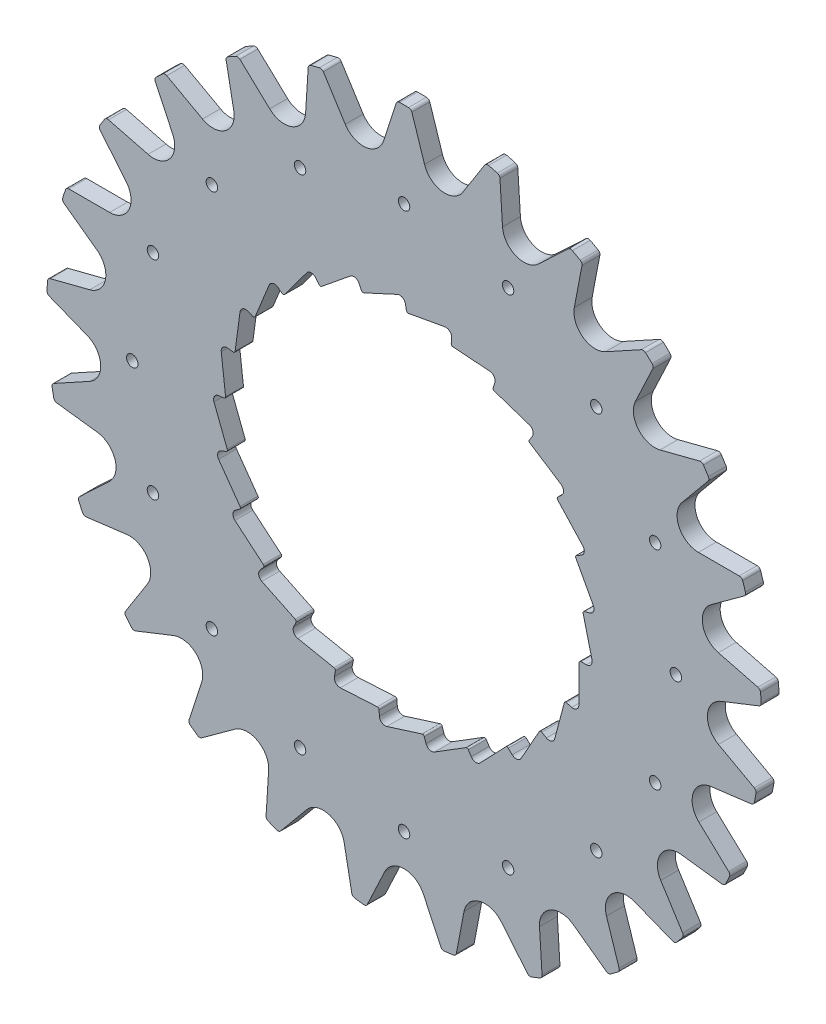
from build123d import *

# Parameters (mm, degrees)
ESQUISSE3_R        = 1.6
BOSS_EXTRU_1_DEPTH = 5


with BuildPart() as part:
    # Esquisse3 → Boss.-Extru.1 (new body)
    with BuildSketch(Plane.XY):
        with BuildLine():
            Line((-5.724871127, 88.406921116), (-2.195441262, 99.269389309))
            ThreePointArc((-2.195441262, 99.269389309), (-1.837244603, 99.765677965), (-1.256958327, 99.960293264))
            ThreePointArc((-1.256958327, 99.960293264), (0, 99.968195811), (1.256958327, 99.960293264))
            ThreePointArc((1.256958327, 99.960293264), (1.837244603, 99.765677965), (2.195441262, 99.269389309))
            Line((2.195441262, 99.269389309), (5.724871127, 88.406921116))
            ThreePointArc((5.724871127, 88.406921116), (7.596834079, 85.652411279), (10.653324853, 84.329749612))
            ThreePointArc((10.653324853, 84.329749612), (13.942722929, 84.850739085), (16.440893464, 87.053172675))
            Line((16.440893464, 87.053172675), (22.560825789, 96.69664294))
            ThreePointArc((22.560825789, 96.69664294), (23.031191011, 97.088259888), (23.641645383, 97.132449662))
            ThreePointArc((23.641645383, 97.132449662), (24.861079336, 96.827511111), (26.076582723, 96.507264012))
            ThreePointArc((26.076582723, 96.507264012), (26.590239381, 96.174451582), (26.813760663, 95.604674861))
            Line((26.813760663, 95.604674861), (27.53092101, 84.205737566))
            ThreePointArc((27.53092101, 84.205737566), (28.659054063, 81.072227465), (31.290586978, 79.031001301))
            ThreePointArc((31.290586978, 79.031001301), (34.606207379, 78.717582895), (37.573616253, 80.229553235))
            Line((37.573616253, 80.229553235), (45.899513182, 88.048090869))
            ThreePointArc((45.899513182, 88.048090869), (46.452492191, 88.310429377), (47.054757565, 88.201417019))
            ThreePointArc((47.054757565, 88.201417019), (48.160045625, 87.602797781), (49.257719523, 86.990328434))
            ThreePointArc((49.257719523, 86.990328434), (49.672471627, 86.540230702), (49.747272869, 85.932767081))
            Line((49.747272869, 85.932767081), (47.607101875, 74.713597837))
            ThreePointArc((47.607101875, 74.713597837), (47.92052028, 71.397977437), (49.961746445, 68.766444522))
            ThreePointArc((49.961746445, 68.766444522), (53.095256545, 67.638311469), (56.345450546, 68.364815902))
            Line((56.345450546, 68.364815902), (66.354165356, 73.867153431))
            ThreePointArc((66.354165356, 73.867153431), (66.955012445, 73.983729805), (67.511246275, 73.728364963))
            ThreePointArc((67.511246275, 73.728364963), (68.432939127, 72.873678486), (69.343812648, 72.007470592))
            ThreePointArc((69.343812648, 72.007470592), (69.633599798, 71.468368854), (69.554980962, 70.861387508))
            Line((69.554980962, 70.861387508), (64.691953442, 60.526927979))
            ThreePointArc((64.691953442, 60.526927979), (64.170963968, 57.237529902), (65.493625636, 54.181039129))
            ThreePointArc((65.493625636, 54.181039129), (68.248135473, 52.309076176), (71.576892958, 52.204465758))
            Line((71.576892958, 52.204465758), (82.639541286, 55.044871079))
            ThreePointArc((82.639541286, 55.044871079), (83.250503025, 55.008360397), (83.725755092, 54.622688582))
            ThreePointArc((83.725755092, 54.622688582), (84.405939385, 53.565637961), (85.072778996, 52.500118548))
            ThreePointArc((85.072778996, 52.500118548), (85.219392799, 51.905886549), (84.992293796, 51.337526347))
            Line((84.992293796, 51.337526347), (77.711971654, 42.537128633))
            ThreePointArc((77.711971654, 42.537128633), (76.389309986, 39.480637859), (76.91029946, 36.191239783))
            ThreePointArc((76.91029946, 36.191239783), (79.11273305, 33.693069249), (82.310895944, 32.763917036))
            Line((82.310895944, 32.763917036), (93.732370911, 32.763917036))
            ThreePointArc((93.732370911, 32.763917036), (94.315058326, 32.576613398), (94.679466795, 32.084867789))
            ThreePointArc((94.679466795, 32.084867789), (95.075404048, 30.891871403), (95.456309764, 29.693990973))
            ThreePointArc((95.456309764, 29.693990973), (95.450537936, 29.081966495), (95.089228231, 28.5879396))
            Line((95.089228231, 28.5879396), (85.849060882, 21.874565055))
            ThreePointArc((85.849060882, 21.874565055), (83.807834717, 19.24303214), (83.494416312, 15.92741174))
            ThreePointArc((83.494416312, 15.92741174), (85.006386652, 12.960002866), (87.87300262, 11.264690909))
            Line((87.87300262, 11.264690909), (98.935650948, 8.424285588))
            ThreePointArc((98.935650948, 8.424285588), (99.453451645, 8.097957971), (99.684119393, 7.531036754))
            ThreePointArc((99.684119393, 7.531036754), (99.770931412, 6.277054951), (99.841969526, 5.022080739))
            ThreePointArc((99.841969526, 5.022080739), (99.684174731, 4.430719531), (99.211356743, 4.042067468))
            Line((99.211356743, 4.042067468), (88.591937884, -0.162457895))
            ThreePointArc((88.591937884, -0.162457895), (85.96040497, -2.203684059), (84.832271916, -5.33719416))
            ThreePointArc((84.832271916, -5.33719416), (85.55877635, -8.587388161), (87.913725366, -10.942337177))
            Line((87.913725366, -10.942337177), (97.922440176, -16.444674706))
            ThreePointArc((97.922440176, -16.444674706), (98.342818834, -16.889521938), (98.425252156, -17.495997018))
            ThreePointArc((98.425252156, -17.495997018), (98.197484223, -18.732171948), (97.954191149, -19.965385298))
            ThreePointArc((97.954191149, -19.965385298), (97.654288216, -20.498925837), (97.099670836, -20.757782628))
            Line((97.099670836, -20.757782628), (85.768257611, -22.189273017))
            ThreePointArc((85.768257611, -22.189273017), (82.711766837, -23.511934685), (80.839803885, -26.266444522))
            ThreePointArc((80.839803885, -26.266444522), (80.735193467, -29.595202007), (82.430505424, -32.461817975))
            Line((82.430505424, -32.461817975), (90.756402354, -40.280355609))
            ThreePointArc((90.756402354, -40.280355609), (91.052945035, -40.815771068), (90.981964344, -41.423692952))
            ThreePointArc((90.981964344, -41.423692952), (90.453927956, -42.564387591), (89.911590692, -43.698352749))
            ThreePointArc((89.911590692, -43.698352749), (89.488423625, -44.140548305), (88.886855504, -44.2533449))
            Line((88.886855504, -44.2533449), (77.555442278, -42.82185451))
            ThreePointArc((77.555442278, -42.82185451), (74.266044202, -43.342843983), (71.767873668, -45.545277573))
            ThreePointArc((71.767873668, -45.545277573), (70.838721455, -48.743440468), (71.767873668, -51.941603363))
            Line((71.767873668, -51.941603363), (77.887805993, -61.585073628))
            ThreePointArc((77.887805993, -61.585073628), (78.041879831, -62.177415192), (77.821945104, -62.748585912))
            ThreePointArc((77.821945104, -62.748585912), (77.026818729, -63.722126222), (76.21951432, -64.685591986))
            ThreePointArc((76.21951432, -64.685591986), (75.699672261, -65.008657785), (75.088952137, -64.968306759))
            Line((75.088952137, -64.968306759), (64.469533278, -60.763781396))
            ThreePointArc((64.469533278, -60.763781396), (61.153912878, -60.45036299), (58.186504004, -61.962333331))
            ThreePointArc((58.186504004, -61.962333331), (56.491192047, -64.828949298), (56.595802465, -68.157706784))
            Line((56.595802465, -68.157706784), (60.125232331, -79.020174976))
            ThreePointArc((60.125232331, -79.020174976), (60.127156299, -79.632223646), (59.772086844, -80.130754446))
            ThreePointArc((59.772086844, -80.130754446), (58.759831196, -80.875969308), (57.738285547, -81.608397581))
            ThreePointArc((57.738285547, -81.608397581), (57.154432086, -81.792034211), (56.572933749, -81.601070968))
            Line((56.572933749, -81.601070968), (47.3327664, -74.887696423))
            ThreePointArc((47.3327664, -74.887696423), (44.1992563, -73.75956337), (40.949062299, -74.486067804))
            ThreePointArc((40.949062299, -74.486067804), (38.594113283, -76.84101682), (37.867608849, -80.091210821))
            Line((37.867608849, -80.091210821), (38.584769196, -91.490148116))
            ThreePointArc((38.584769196, -91.490148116), (38.434422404, -92.083446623), (37.966528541, -92.478012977))
            ThreePointArc((37.966528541, -92.478012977), (36.800747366, -92.948077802), (35.629147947, -93.403447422))
            ThreePointArc((35.629147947, -93.403447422), (35.017968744, -93.436116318), (34.502229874, -93.10653978))
            Line((34.502229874, -93.10653978), (27.221907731, -84.306142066))
            ThreePointArc((27.221907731, -84.306142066), (24.467397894, -82.434179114), (21.138640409, -82.329568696))
            ThreePointArc((21.138640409, -82.329568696), (18.272024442, -84.024880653), (16.760054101, -86.992289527))
            Line((16.760054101, -86.992289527), (14.619883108, -98.211458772))
            ThreePointArc((14.619883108, -98.211458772), (14.326712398, -98.748727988), (13.775393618, -99.014537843))
            ThreePointArc((13.775393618, -99.014537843), (12.529337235, -99.179916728), (11.281299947, -99.329615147))
            ThreePointArc((11.281299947, -99.329615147), (10.681197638, -99.209263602), (10.263624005, -98.761782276))
            Line((10.263624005, -98.761782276), (5.400596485, -88.427322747))
            ThreePointArc((5.400596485, -88.427322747), (3.198162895, -85.929152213), (0, -85))
            ThreePointArc((0, -85), (-3.198162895, -85.929152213), (-5.400596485, -88.427322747))
            Line((-5.400596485, -88.427322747), (-10.263624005, -98.761782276))
            ThreePointArc((-10.263624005, -98.761782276), (-10.681197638, -99.209263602), (-11.281299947, -99.329615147))
            ThreePointArc((-11.281299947, -99.329615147), (-12.529337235, -99.179916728), (-13.775393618, -99.014537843))
            ThreePointArc((-13.775393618, -99.014537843), (-14.326712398, -98.748727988), (-14.619883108, -98.211458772))
            Line((-14.619883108, -98.211458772), (-16.760054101, -86.992289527))
            ThreePointArc((-16.760054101, -86.992289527), (-18.272024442, -84.024880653), (-21.138640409, -82.329568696))
            ThreePointArc((-21.138640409, -82.329568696), (-24.467397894, -82.434179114), (-27.221907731, -84.306142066))
            Line((-27.221907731, -84.306142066), (-34.502229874, -93.10653978))
            ThreePointArc((-34.502229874, -93.10653978), (-35.017968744, -93.436116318), (-35.629147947, -93.403447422))
            ThreePointArc((-35.629147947, -93.403447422), (-36.800747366, -92.948077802), (-37.966528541, -92.478012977))
            ThreePointArc((-37.966528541, -92.478012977), (-38.434422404, -92.083446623), (-38.584769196, -91.490148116))
            Line((-38.584769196, -91.490148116), (-37.867608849, -80.091210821))
            ThreePointArc((-37.867608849, -80.091210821), (-38.594113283, -76.84101682), (-40.949062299, -74.486067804))
            ThreePointArc((-40.949062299, -74.486067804), (-44.1992563, -73.75956337), (-47.3327664, -74.887696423))
            Line((-47.3327664, -74.887696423), (-56.572933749, -81.601070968))
            ThreePointArc((-56.572933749, -81.601070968), (-57.154432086, -81.792034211), (-57.738285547, -81.608397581))
            ThreePointArc((-57.738285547, -81.608397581), (-58.759831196, -80.875969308), (-59.772086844, -80.130754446))
            ThreePointArc((-59.772086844, -80.130754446), (-60.127156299, -79.632223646), (-60.125232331, -79.020174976))
            Line((-60.125232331, -79.020174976), (-56.595802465, -68.157706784))
            ThreePointArc((-56.595802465, -68.157706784), (-56.491192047, -64.828949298), (-58.186504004, -61.962333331))
            ThreePointArc((-58.186504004, -61.962333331), (-61.153912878, -60.45036299), (-64.469533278, -60.763781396))
            Line((-64.469533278, -60.763781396), (-75.088952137, -64.968306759))
            ThreePointArc((-75.088952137, -64.968306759), (-75.699672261, -65.008657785), (-76.21951432, -64.685591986))
            ThreePointArc((-76.21951432, -64.685591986), (-77.026818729, -63.722126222), (-77.821945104, -62.748585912))
            ThreePointArc((-77.821945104, -62.748585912), (-78.041879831, -62.177415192), (-77.887805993, -61.585073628))
            Line((-77.887805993, -61.585073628), (-71.767873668, -51.941603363))
            ThreePointArc((-71.767873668, -51.941603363), (-70.838721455, -48.743440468), (-71.767873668, -45.545277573))
            ThreePointArc((-71.767873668, -45.545277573), (-74.266044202, -43.342843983), (-77.555442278, -42.82185451))
            Line((-77.555442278, -42.82185451), (-88.886855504, -44.2533449))
            ThreePointArc((-88.886855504, -44.2533449), (-89.488423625, -44.140548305), (-89.911590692, -43.698352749))
            ThreePointArc((-89.911590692, -43.698352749), (-90.453927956, -42.564387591), (-90.981964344, -41.423692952))
            ThreePointArc((-90.981964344, -41.423692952), (-91.052945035, -40.815771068), (-90.756402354, -40.280355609))
            Line((-90.756402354, -40.280355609), (-82.430505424, -32.461817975))
            ThreePointArc((-82.430505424, -32.461817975), (-80.735193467, -29.595202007), (-80.839803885, -26.266444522))
            ThreePointArc((-80.839803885, -26.266444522), (-82.711766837, -23.511934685), (-85.768257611, -22.189273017))
            Line((-85.768257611, -22.189273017), (-97.099670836, -20.757782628))
            ThreePointArc((-97.099670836, -20.757782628), (-97.654288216, -20.498925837), (-97.954191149, -19.965385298))
            ThreePointArc((-97.954191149, -19.965385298), (-98.197484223, -18.732171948), (-98.425252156, -17.495997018))
            ThreePointArc((-98.425252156, -17.495997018), (-98.342818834, -16.889521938), (-97.922440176, -16.444674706))
            Line((-97.922440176, -16.444674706), (-87.913725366, -10.942337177))
            ThreePointArc((-87.913725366, -10.942337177), (-85.55877635, -8.587388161), (-84.832271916, -5.33719416))
            ThreePointArc((-84.832271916, -5.33719416), (-85.96040497, -2.203684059), (-88.591937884, -0.162457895))
            Line((-88.591937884, -0.162457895), (-99.211356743, 4.042067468))
            ThreePointArc((-99.211356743, 4.042067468), (-99.684174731, 4.430719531), (-99.841969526, 5.022080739))
            ThreePointArc((-99.841969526, 5.022080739), (-99.770931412, 6.277054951), (-99.684119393, 7.531036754))
            ThreePointArc((-99.684119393, 7.531036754), (-99.453451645, 8.097957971), (-98.935650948, 8.424285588))
            Line((-98.935650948, 8.424285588), (-87.87300262, 11.264690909))
            ThreePointArc((-87.87300262, 11.264690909), (-85.006386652, 12.960002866), (-83.494416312, 15.92741174))
            ThreePointArc((-83.494416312, 15.92741174), (-83.807834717, 19.24303214), (-85.849060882, 21.874565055))
            Line((-85.849060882, 21.874565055), (-95.089228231, 28.5879396))
            ThreePointArc((-95.089228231, 28.5879396), (-95.450537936, 29.081966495), (-95.456309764, 29.693990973))
            ThreePointArc((-95.456309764, 29.693990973), (-95.075404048, 30.891871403), (-94.679466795, 32.084867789))
            ThreePointArc((-94.679466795, 32.084867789), (-94.315058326, 32.576613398), (-93.732370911, 32.763917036))
            Line((-93.732370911, 32.763917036), (-82.310895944, 32.763917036))
            ThreePointArc((-82.310895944, 32.763917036), (-79.11273305, 33.693069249), (-76.91029946, 36.191239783))
            ThreePointArc((-76.91029946, 36.191239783), (-76.389309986, 39.480637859), (-77.711971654, 42.537128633))
            Line((-77.711971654, 42.537128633), (-84.992293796, 51.337526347))
            ThreePointArc((-84.992293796, 51.337526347), (-85.219392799, 51.905886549), (-85.072778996, 52.500118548))
            ThreePointArc((-85.072778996, 52.500118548), (-84.405939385, 53.565637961), (-83.725755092, 54.622688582))
            ThreePointArc((-83.725755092, 54.622688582), (-83.250503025, 55.008360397), (-82.639541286, 55.044871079))
            Line((-82.639541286, 55.044871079), (-71.576892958, 52.204465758))
            ThreePointArc((-71.576892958, 52.204465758), (-68.248135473, 52.309076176), (-65.493625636, 54.181039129))
            ThreePointArc((-65.493625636, 54.181039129), (-64.170963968, 57.237529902), (-64.691953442, 60.526927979))
            Line((-64.691953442, 60.526927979), (-69.554980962, 70.861387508))
            ThreePointArc((-69.554980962, 70.861387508), (-69.633599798, 71.468368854), (-69.343812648, 72.007470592))
            ThreePointArc((-69.343812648, 72.007470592), (-68.432939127, 72.873678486), (-67.511246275, 73.728364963))
            ThreePointArc((-67.511246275, 73.728364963), (-66.955012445, 73.983729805), (-66.354165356, 73.867153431))
            Line((-66.354165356, 73.867153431), (-56.345450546, 68.364815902))
            ThreePointArc((-56.345450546, 68.364815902), (-53.095256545, 67.638311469), (-49.961746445, 68.766444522))
            ThreePointArc((-49.961746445, 68.766444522), (-47.92052028, 71.397977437), (-47.607101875, 74.713597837))
            Line((-47.607101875, 74.713597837), (-49.747272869, 85.932767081))
            ThreePointArc((-49.747272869, 85.932767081), (-49.672471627, 86.540230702), (-49.257719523, 86.990328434))
            ThreePointArc((-49.257719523, 86.990328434), (-48.160045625, 87.602797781), (-47.054757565, 88.201417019))
            ThreePointArc((-47.054757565, 88.201417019), (-46.452492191, 88.310429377), (-45.899513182, 88.048090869))
            Line((-45.899513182, 88.048090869), (-37.573616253, 80.229553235))
            ThreePointArc((-37.573616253, 80.229553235), (-34.606207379, 78.717582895), (-31.290586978, 79.031001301))
            ThreePointArc((-31.290586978, 79.031001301), (-28.659054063, 81.072227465), (-27.53092101, 84.205737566))
            Line((-27.53092101, 84.205737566), (-26.813760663, 95.604674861))
            ThreePointArc((-26.813760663, 95.604674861), (-26.590239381, 96.174451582), (-26.076582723, 96.507264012))
            ThreePointArc((-26.076582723, 96.507264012), (-24.861079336, 96.827511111), (-23.641645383, 97.132449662))
            ThreePointArc((-23.641645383, 97.132449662), (-23.031191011, 97.088259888), (-22.560825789, 96.69664294))
            Line((-22.560825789, 96.69664294), (-16.440893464, 87.053172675))
            ThreePointArc((-16.440893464, 87.053172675), (-13.942722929, 84.850739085), (-10.653324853, 84.329749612))
            ThreePointArc((-10.653324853, 84.329749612), (-7.596834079, 85.652411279), (-5.724871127, 88.406921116))
        make_face()
        with Locations((0, 76)):
            Circle(ESQUISSE3_R, mode=Mode.SUBTRACT)
        with Locations((29.08394086, 70.214844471)):
            Circle(ESQUISSE3_R, mode=Mode.SUBTRACT)
        with Locations((53.74011537, 53.74011537)):
            Circle(ESQUISSE3_R, mode=Mode.SUBTRACT)
        with Locations((70.214844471, 29.08394086)):
            Circle(ESQUISSE3_R, mode=Mode.SUBTRACT)
        with Locations((76, 0)):
            Circle(ESQUISSE3_R, mode=Mode.SUBTRACT)
        with Locations((70.214844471, -29.08394086)):
            Circle(ESQUISSE3_R, mode=Mode.SUBTRACT)
        with Locations((53.74011537, -53.74011537)):
            Circle(ESQUISSE3_R, mode=Mode.SUBTRACT)
        with Locations((29.08394086, -70.214844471)):
            Circle(ESQUISSE3_R, mode=Mode.SUBTRACT)
        with Locations((0, -76)):
            Circle(ESQUISSE3_R, mode=Mode.SUBTRACT)
        with Locations((-29.08394086, -70.214844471)):
            Circle(ESQUISSE3_R, mode=Mode.SUBTRACT)
        with Locations((-53.74011537, -53.74011537)):
            Circle(ESQUISSE3_R, mode=Mode.SUBTRACT)
        with Locations((-70.214844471, -29.08394086)):
            Circle(ESQUISSE3_R, mode=Mode.SUBTRACT)
        with Locations((-76, 0)):
            Circle(ESQUISSE3_R, mode=Mode.SUBTRACT)
        with Locations((-70.214844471, 29.08394086)):
            Circle(ESQUISSE3_R, mode=Mode.SUBTRACT)
        with Locations((-53.74011537, 53.74011537)):
            Circle(ESQUISSE3_R, mode=Mode.SUBTRACT)
        with Locations((-29.08394086, 70.214844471)):
            Circle(ESQUISSE3_R, mode=Mode.SUBTRACT)
        with BuildLine():
            Line((0.377930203, 51.984372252), (0.658373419, 50.4886751))
            ThreePointArc((0.658373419, 50.4886751), (0.866306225, 50.168962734), (1.239183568, 50.088871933))
            Line((1.239183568, 50.088871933), (11.411528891, 51.936922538))
            ThreePointArc((11.411528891, 51.936922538), (12.762764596, 51.556535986), (13.2940445, 50.257200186))
            Line((13.2940445, 50.257200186), (13.193712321, 48.738749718))
            ThreePointArc((13.193712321, 48.738749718), (13.315603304, 48.377370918), (13.656848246, 48.207065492))
            Line((13.656848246, 48.207065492), (23.969202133, 47.467296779))
            ThreePointArc((23.969202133, 47.467296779), (25.183387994, 46.762822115), (25.37484509, 45.372183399))
            Line((25.37484509, 45.372183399), (24.900041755, 43.926389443))
            ThreePointArc((24.900041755, 43.926389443), (24.928232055, 43.546050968), (25.216402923, 43.296231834))
            Line((25.216402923, 43.296231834), (35.020802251, 40.015126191))
            ThreePointArc((35.020802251, 40.015126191), (36.021646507, 39.030828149), (35.86125084, 37.636265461))
            Line((35.86125084, 37.636265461), (35.041809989, 36.353972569))
            ThreePointArc((35.041809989, 36.353972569), (34.974528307, 35.978572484), (35.191518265, 35.664936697))
            Line((35.191518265, 35.664936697), (43.871916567, 30.048658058))
            ThreePointArc((43.871916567, 30.048658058), (44.596532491, 28.846383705), (44.094362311, 27.535522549))
            Line((44.094362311, 27.535522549), (42.981772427, 26.497301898))
            ThreePointArc((42.981772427, 26.497301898), (42.823246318, 26.150427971), (42.955421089, 25.792682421))
            Line((42.955421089, 25.792682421), (49.966397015, 18.194122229))
            ThreePointArc((49.966397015, 18.194122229), (50.369254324, 16.849414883), (49.556862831, 15.704621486))
            Line((49.556862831, 15.704621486), (48.221032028, 14.975708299))
            ThreePointArc((48.221032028, 14.975708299), (47.98122227, 14.679155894), (48.020276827, 14.299779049))
            Line((48.020276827, 14.299779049), (52.921304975, 5.196382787))
            ThreePointArc((52.921304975, 5.196382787), (52.977090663, 3.793735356), (51.905523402, 2.886941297))
            Line((51.905523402, 2.886941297), (50.430386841, 2.513135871))
            ThreePointArc((50.430386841, 2.513135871), (50.124361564, 2.285538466), (50.067841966, 1.908367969))
            Line((50.067841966, 1.908367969), (52.550972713, -8.127864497))
            ThreePointArc((52.550972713, -8.127864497), (52.256181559, -9.500318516), (50.992769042, -10.11213603))
            Line((50.992769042, -10.11213603), (49.47101498, -10.107346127))
            ThreePointArc((49.47101498, -10.107346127), (49.118002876, -10.251687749), (48.969460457, -10.602952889))
            Line((48.969460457, -10.602952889), (48.878669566, -20.941408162))
            ThreePointArc((48.878669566, -20.941408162), (48.251824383, -22.197432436), (46.875951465, -22.475830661))
            Line((46.875951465, -22.475830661), (45.403197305, -22.092746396))
            ThreePointArc((45.403197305, -22.092746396), (45.025379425, -22.14476272), (44.794147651, -22.448051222))
            Line((44.794147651, -22.448051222), (42.135139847, -32.439126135))
            ThreePointArc((42.135139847, -32.439126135), (41.215627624, -33.499800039), (39.81374546, -33.427286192))
            Line((39.81374546, -33.427286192), (38.482529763, -32.689978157))
            ThreePointArc((38.482529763, -32.689978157), (38.103645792, -32.646400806), (37.804253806, -32.882655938))
            Line((37.804253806, -32.882655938), (32.74410433, -41.898574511))
            ThreePointArc((32.74410433, -41.898574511), (31.5897014, -42.697252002), (30.249895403, -42.278382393))
            Line((30.249895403, -42.278382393), (29.143863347, -41.233178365))
            ThreePointArc((29.143863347, -41.233178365), (28.787719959, -41.096745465), (28.438979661, -41.251122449))
            Line((28.438979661, -41.251122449), (21.295636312, -48.725381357))
            ThreePointArc((21.295636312, -48.725381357), (19.978878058, -49.211878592), (18.785333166, -48.47297234))
            Line((18.785333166, -48.47297234), (17.973980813, -47.185546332))
            ThreePointArc((17.973980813, -47.185546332), (17.662955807, -46.964830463), (17.286779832, -47.027629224))
            Line((17.286779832, -47.027629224), (8.509085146, -52.490593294))
            ThreePointArc((8.509085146, -52.490593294), (7.112708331, -52.634341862), (6.140419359, -51.621827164))
            Line((6.140419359, -51.621827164), (5.674726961, -50.173072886))
            ThreePointArc((5.674726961, -50.173072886), (5.428363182, -49.881942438), (5.04838805, -49.8492171))
            Line((5.04838805, -49.8492171), (-4.812123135, -52.957628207))
            ThreePointArc((-4.812123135, -52.957628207), (-6.200379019, -52.749595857), (-6.890319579, -51.527092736))
            Line((-6.890319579, -51.527092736), (-6.981090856, -50.008040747))
            ThreePointArc((-6.981090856, -50.008040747), (-7.147313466, -49.664788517), (-7.50721252, -49.538595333))
            Line((-7.50721252, -49.538595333), (-17.830968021, -50.097140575))
            ThreePointArc((-17.830968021, -50.097140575), (-19.123873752, -49.550398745), (-19.488114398, -48.194721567))
            Line((-19.488114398, -48.194721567), (-19.19826106, -46.700819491))
            ThreePointArc((-19.19826106, -46.700819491), (-19.273898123, -46.32701328), (-19.591107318, -46.115281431))
            Line((-19.591107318, -46.115281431), (-29.729427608, -44.088865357))
            ThreePointArc((-29.729427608, -44.088865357), (-30.845745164, -43.237767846), (-30.861399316, -41.834098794))
            Line((-30.861399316, -41.834098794), (-30.209133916, -40.459213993))
            ThreePointArc((-30.209133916, -40.459213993), (-30.189432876, -40.078341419), (-30.444020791, -39.794374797))
            Line((-30.444020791, -39.794374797), (-39.759877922, -35.31032458))
            ThreePointArc((-39.759877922, -35.31032458), (-40.629464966, -34.208348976), (-40.295549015, -32.844885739))
            Line((-40.295549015, -32.844885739), (-39.321855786, -31.675407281))
            ThreePointArc((-39.321855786, -31.675407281), (-39.208054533, -31.311399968), (-39.384024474, -30.97304124))
            Line((-39.384024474, -30.97304124), (-47.29206888, -24.313106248))
            ThreePointArc((-47.29206888, -24.313106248), (-47.860286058, -23.02949373), (-47.197781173, -21.791907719))
            Line((-47.197781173, -21.791907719), (-45.963840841, -20.901318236))
            ThreePointArc((-45.963840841, -20.901318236), (-45.763089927, -20.577048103), (-45.849385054, -20.205557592))
            Line((-45.849385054, -20.205557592), (-51.852725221, -11.788206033))
            ThreePointArc((-51.852725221, -11.788206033), (-52.08386936, -10.403610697), (-51.134403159, -9.369663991))
            Line((-51.134403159, -9.369663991), (-49.717748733, -8.813922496))
            ThreePointArc((-49.717748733, -8.813922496), (-49.442662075, -8.549764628), (-49.433860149, -8.168484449))
            Line((-49.433860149, -8.168484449), (-53.155284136, 1.477390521))
            ThreePointArc((-53.155284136, 1.477390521), (-53.034831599, 2.875969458), (-51.858062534, 3.641310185))
            Line((-51.858062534, 3.641310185), (-50.347707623, 3.827284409))
            ThreePointArc((-50.347707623, 3.827284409), (-50.015569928, 4.014732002), (-49.912224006, 4.381844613))
            Line((-49.912224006, 4.381844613), (-51.117901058, 14.650157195))
            ThreePointArc((-51.117901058, 14.650157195), (-50.65342032, 15.974841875), (-49.323289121, 16.42348745))
            Line((-49.323289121, 16.42348745), (-47.814134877, 16.228008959))
            ThreePointArc((-47.814134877, 16.228008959), (-47.445815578, 16.326968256), (-47.254419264, 16.656846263))
            Line((-47.254419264, 16.656846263), (-45.868592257, 26.902400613))
            ThreePointArc((-45.868592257, 26.902400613), (-45.089268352, 28.069956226), (-43.689352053, 28.173716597))
            Line((-43.689352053, 28.173716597), (-42.276224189, 27.609068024))
            ThreePointArc((-42.276224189, 27.609068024), (-41.894866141, 27.613321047), (-41.62744557, 27.885237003))
            Line((-41.62744557, 27.885237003), (-37.737191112, 37.46426726))
            ThreePointArc((-37.737191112, 37.46426726), (-36.691991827, 38.401331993), (-35.310252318, 38.153687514))
            Line((-35.310252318, 38.153687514), (-34.081942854, 37.255347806))
            ThreePointArc((-34.081942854, 37.255347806), (-33.711508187, 37.164627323), (-33.384866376, 37.361495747))
            Line((-33.384866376, 37.361495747), (-27.234623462, 45.672116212))
            ThreePointArc((-27.234623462, 45.672116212), (-25.989222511, 46.319810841), (-24.712479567, 45.736321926))
            Line((-24.712479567, 45.736321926), (-23.746167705, 44.56073707))
            ThreePointArc((-23.746167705, 44.56073707), (-23.409932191, 44.380743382), (-23.044593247, 44.490194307))
            Line((-23.044593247, 44.490194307), (-15.020804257, 51.010218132))
            ThreePointArc((-15.020804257, 51.010218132), (-13.653454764, 51.327845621), (-12.561930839, 50.445175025))
            Line((-12.561930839, 50.445175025), (-11.918333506, 49.06621134))
            ThreePointArc((-11.918333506, 49.06621134), (-11.637424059, 48.808254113), (-11.256343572, 48.823410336))
            Line((-11.256343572, 48.823410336), (-1.863172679, 53.143160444))
            ThreePointArc((-1.863172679, 53.143160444), (-0.45979024, 53.11076309), (0.377930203, 51.984372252))
        make_face(mode=Mode.SUBTRACT)
    extrude(amount=BOSS_EXTRU_1_DEPTH)


solid = part.part
